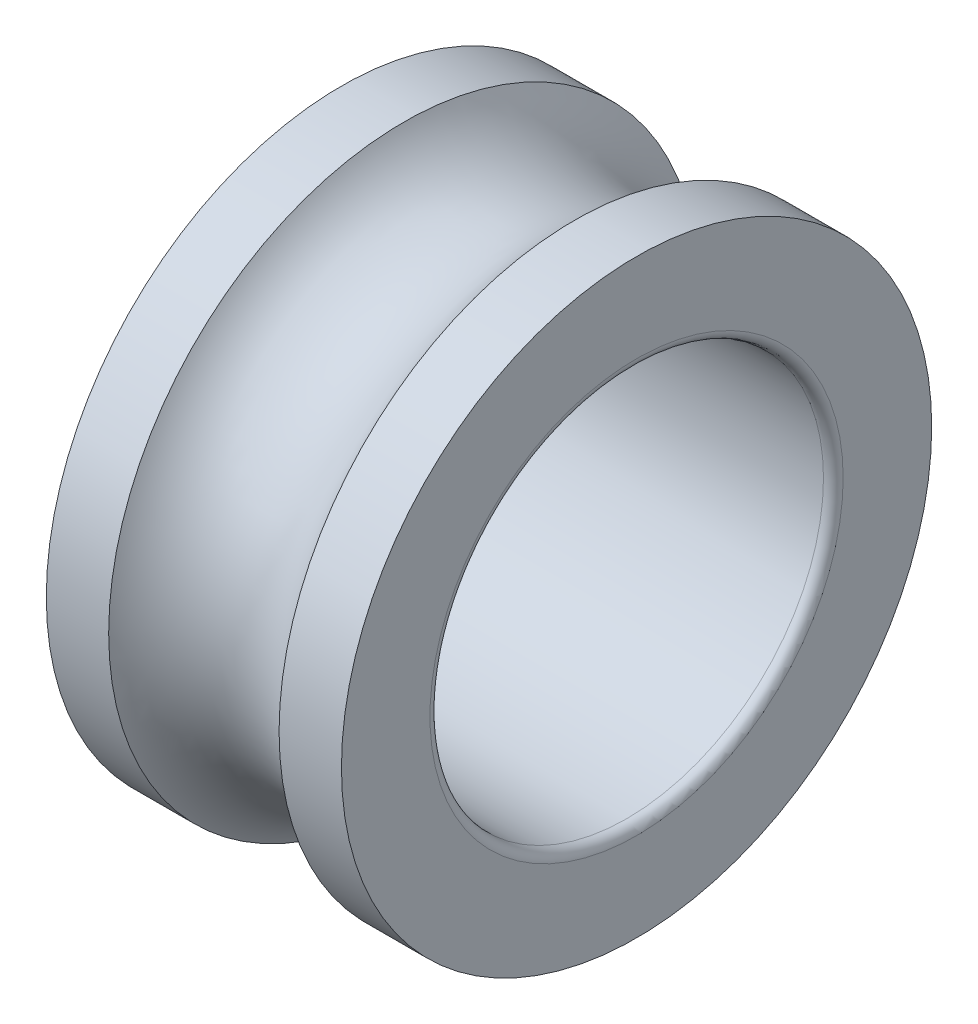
ISO-10303-21;
HEADER;
FILE_DESCRIPTION(('STEP AP214'),'2;1');
FILE_NAME('part.step','',(''),(''),'','','');
FILE_SCHEMA(('AUTOMOTIVE_DESIGN { 1 0 10303 214 1 1 1 1 }'));
ENDSEC;
DATA;
#1=APPLICATION_CONTEXT('core data for automotive mechanical design processes');
#2=APPLICATION_PROTOCOL_DEFINITION('international standard','automotive_design',2000,#1);
#3=PRODUCT_CONTEXT('',#1,'mechanical');
#4=PRODUCT('Part','Part','',(#3));
#5=PRODUCT_RELATED_PRODUCT_CATEGORY('part','',(#4));
#6=PRODUCT_DEFINITION_FORMATION('','',#4);
#7=PRODUCT_DEFINITION_CONTEXT('part definition',#1,'design');
#8=PRODUCT_DEFINITION('design','',#6,#7);
#9=PRODUCT_DEFINITION_SHAPE('','',#8);
#10=(LENGTH_UNIT() NAMED_UNIT(*) SI_UNIT(.MILLI.,.METRE.));
#11=(NAMED_UNIT(*) PLANE_ANGLE_UNIT() SI_UNIT($,.RADIAN.));
#12=(NAMED_UNIT(*) SI_UNIT($,.STERADIAN.) SOLID_ANGLE_UNIT());
#13=UNCERTAINTY_MEASURE_WITH_UNIT(LENGTH_MEASURE(1.E-05),#10,'distance_accuracy_value','');
#14=(GEOMETRIC_REPRESENTATION_CONTEXT(3) GLOBAL_UNCERTAINTY_ASSIGNED_CONTEXT((#13)) GLOBAL_UNIT_ASSIGNED_CONTEXT((#10,
#11,#12)) REPRESENTATION_CONTEXT('',''));
#15=CARTESIAN_POINT('',(0.,0.,0.));
#16=DIRECTION('',(0.,0.,1.));
#17=DIRECTION('',(1.,0.,0.));
#18=AXIS2_PLACEMENT_3D('',#15,#16,#17);
#19=CARTESIAN_POINT('',(-2.99999999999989,3.9999999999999,0.));
#20=DIRECTION('',(-1.,0.,0.));
#21=DIRECTION('',(0.,0.,1.));
#22=AXIS2_PLACEMENT_3D('',#19,#20,#21);
#23=PLANE('',#22);
#24=CARTESIAN_POINT('',(-2.99999999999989,-1.11022302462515E-13,0.));
#25=DIRECTION('',(-1.,0.,0.));
#26=DIRECTION('',(0.,0.,1.));
#27=AXIS2_PLACEMENT_3D('',#24,#25,#26);
#28=CIRCLE('',#27,4.2);
#29=CARTESIAN_POINT('',(-2.99999999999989,-1.11022302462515E-13,4.2));
#30=VERTEX_POINT('',#29);
#31=EDGE_CURVE('E360',#30,#30,#28,.F.);
#32=ORIENTED_EDGE('',*,*,#31,.T.);
#33=EDGE_LOOP('',(#32));
#34=FACE_BOUND('',#33,.T.);
#35=CARTESIAN_POINT('',(-2.99999999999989,-1.11022302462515E-13,0.));
#36=DIRECTION('',(-1.,0.,0.));
#37=DIRECTION('',(0.,0.,1.));
#38=AXIS2_PLACEMENT_3D('',#35,#36,#37);
#39=CIRCLE('',#38,6.);
#40=CARTESIAN_POINT('',(-2.99999999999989,-1.11022302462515E-13,6.));
#41=VERTEX_POINT('',#40);
#42=EDGE_CURVE('E382',#41,#41,#39,.T.);
#43=ORIENTED_EDGE('',*,*,#42,.T.);
#44=EDGE_LOOP('',(#43));
#45=FACE_BOUND('',#44,.T.);
#46=ADVANCED_FACE('F354',(#34,#45),#23,.T.);
#47=CARTESIAN_POINT('',(-8.450166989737,-1.11022302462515E-13,0.));
#48=DIRECTION('',(-1.,0.,0.));
#49=DIRECTION('',(0.,0.,1.));
#50=AXIS2_PLACEMENT_3D('',#47,#48,#49);
#51=CYLINDRICAL_SURFACE('',#50,4.);
#52=CARTESIAN_POINT('',(-2.79999999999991,-1.11022302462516E-13,0.));
#53=DIRECTION('',(-1.,0.,0.));
#54=DIRECTION('',(0.,0.,1.));
#55=AXIS2_PLACEMENT_3D('',#52,#53,#54);
#56=CIRCLE('',#55,4.);
#57=CARTESIAN_POINT('',(-2.79999999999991,-1.11022302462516E-13,4.));
#58=VERTEX_POINT('',#57);
#59=EDGE_CURVE('E364',#58,#58,#56,.T.);
#60=ORIENTED_EDGE('',*,*,#59,.T.);
#61=EDGE_LOOP('',(#60));
#62=FACE_BOUND('',#61,.T.);
#63=CARTESIAN_POINT('',(2.79999999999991,0.,0.));
#64=DIRECTION('',(1.,0.,0.));
#65=DIRECTION('',(0.,0.,-1.));
#66=AXIS2_PLACEMENT_3D('',#63,#64,#65);
#67=CIRCLE('',#66,4.);
#68=CARTESIAN_POINT('',(2.79999999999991,0.,-4.));
#69=VERTEX_POINT('',#68);
#70=EDGE_CURVE('E368',#69,#69,#67,.T.);
#71=ORIENTED_EDGE('',*,*,#70,.T.);
#72=EDGE_LOOP('',(#71));
#73=FACE_BOUND('',#72,.T.);
#74=ADVANCED_FACE('F406',(#62,#73),#51,.F.);
#75=CARTESIAN_POINT('',(2.99999999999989,6.00000000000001,0.));
#76=DIRECTION('',(1.,0.,0.));
#77=DIRECTION('',(0.,0.,-1.));
#78=AXIS2_PLACEMENT_3D('',#75,#76,#77);
#79=PLANE('',#78);
#80=CARTESIAN_POINT('',(2.99999999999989,0.,0.));
#81=DIRECTION('',(1.,0.,0.));
#82=DIRECTION('',(0.,0.,-1.));
#83=AXIS2_PLACEMENT_3D('',#80,#81,#82);
#84=CIRCLE('',#83,4.2);
#85=CARTESIAN_POINT('',(2.99999999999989,0.,-4.2));
#86=VERTEX_POINT('',#85);
#87=EDGE_CURVE('E12',#86,#86,#84,.F.);
#88=ORIENTED_EDGE('',*,*,#87,.T.);
#89=EDGE_LOOP('',(#88));
#90=FACE_BOUND('',#89,.T.);
#91=CARTESIAN_POINT('',(2.99999999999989,0.,0.));
#92=DIRECTION('',(-1.,0.,0.));
#93=DIRECTION('',(0.,0.,1.));
#94=AXIS2_PLACEMENT_3D('',#91,#92,#93);
#95=CIRCLE('',#94,6.);
#96=CARTESIAN_POINT('',(2.99999999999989,0.,6.));
#97=VERTEX_POINT('',#96);
#98=EDGE_CURVE('E373',#97,#97,#95,.T.);
#99=ORIENTED_EDGE('',*,*,#98,.F.);
#100=EDGE_LOOP('',(#99));
#101=FACE_BOUND('',#100,.T.);
#102=ADVANCED_FACE('F402',(#90,#101),#79,.T.);
#103=CARTESIAN_POINT('',(-8.450166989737,-1.11022302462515E-13,0.));
#104=DIRECTION('',(-1.,0.,0.));
#105=DIRECTION('',(0.,0.,1.));
#106=AXIS2_PLACEMENT_3D('',#103,#104,#105);
#107=CYLINDRICAL_SURFACE('',#106,6.);
#108=CARTESIAN_POINT('',(1.73205080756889,0.,0.));
#109=DIRECTION('',(-1.,0.,0.));
#110=DIRECTION('',(0.,0.,1.));
#111=AXIS2_PLACEMENT_3D('',#108,#109,#110);
#112=CIRCLE('',#111,6.);
#113=CARTESIAN_POINT('',(1.73205080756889,0.,6.));
#114=VERTEX_POINT('',#113);
#115=EDGE_CURVE('E376',#114,#114,#112,.T.);
#116=ORIENTED_EDGE('',*,*,#115,.F.);
#117=EDGE_LOOP('',(#116));
#118=FACE_BOUND('',#117,.T.);
#119=ORIENTED_EDGE('',*,*,#98,.T.);
#120=EDGE_LOOP('',(#119));
#121=FACE_BOUND('',#120,.T.);
#122=ADVANCED_FACE('F396',(#118,#121),#107,.T.);
#123=CARTESIAN_POINT('',(0.,0.,0.));
#124=DIRECTION('',(-1.,0.,0.));
#125=DIRECTION('',(0.,0.,1.));
#126=AXIS2_PLACEMENT_3D('',#123,#124,#125);
#127=TOROIDAL_SURFACE('',#126,7.,2.);
#128=ORIENTED_EDGE('',*,*,#115,.T.);
#129=EDGE_LOOP('',(#128));
#130=FACE_BOUND('',#129,.T.);
#131=CARTESIAN_POINT('',(-1.73205080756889,0.,0.));
#132=DIRECTION('',(-1.,0.,0.));
#133=DIRECTION('',(0.,0.,1.));
#134=AXIS2_PLACEMENT_3D('',#131,#132,#133);
#135=CIRCLE('',#134,6.);
#136=CARTESIAN_POINT('',(-1.73205080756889,0.,6.));
#137=VERTEX_POINT('',#136);
#138=EDGE_CURVE('E379',#137,#137,#135,.T.);
#139=ORIENTED_EDGE('',*,*,#138,.F.);
#140=EDGE_LOOP('',(#139));
#141=FACE_BOUND('',#140,.T.);
#142=ADVANCED_FACE('F391',(#130,#141),#127,.F.);
#143=CARTESIAN_POINT('',(-8.450166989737,-1.11022302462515E-13,0.));
#144=DIRECTION('',(-1.,0.,0.));
#145=DIRECTION('',(0.,0.,1.));
#146=AXIS2_PLACEMENT_3D('',#143,#144,#145);
#147=CYLINDRICAL_SURFACE('',#146,6.);
#148=ORIENTED_EDGE('',*,*,#42,.F.);
#149=EDGE_LOOP('',(#148));
#150=FACE_BOUND('',#149,.T.);
#151=ORIENTED_EDGE('',*,*,#138,.T.);
#152=EDGE_LOOP('',(#151));
#153=FACE_BOUND('',#152,.T.);
#154=ADVANCED_FACE('F387',(#150,#153),#147,.T.);
#155=CARTESIAN_POINT('',(-2.79999999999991,-1.11022302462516E-13,0.));
#156=DIRECTION('',(-1.,0.,0.));
#157=DIRECTION('',(0.,0.,1.));
#158=AXIS2_PLACEMENT_3D('',#155,#156,#157);
#159=TOROIDAL_SURFACE('',#158,4.2,0.2);
#160=ORIENTED_EDGE('',*,*,#31,.F.);
#161=EDGE_LOOP('',(#160));
#162=FACE_BOUND('',#161,.T.);
#163=ORIENTED_EDGE('',*,*,#59,.F.);
#164=EDGE_LOOP('',(#163));
#165=FACE_BOUND('',#164,.T.);
#166=ADVANCED_FACE('F390',(#162,#165),#159,.T.);
#167=CARTESIAN_POINT('',(2.79999999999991,0.,0.));
#168=DIRECTION('',(1.,0.,0.));
#169=DIRECTION('',(0.,0.,-1.));
#170=AXIS2_PLACEMENT_3D('',#167,#168,#169);
#171=TOROIDAL_SURFACE('',#170,4.2,0.2);
#172=ORIENTED_EDGE('',*,*,#70,.F.);
#173=EDGE_LOOP('',(#172));
#174=FACE_BOUND('',#173,.T.);
#175=ORIENTED_EDGE('',*,*,#87,.F.);
#176=EDGE_LOOP('',(#175));
#177=FACE_BOUND('',#176,.T.);
#178=ADVANCED_FACE('F419',(#174,#177),#171,.T.);
#179=CLOSED_SHELL('',(#46,#74,#102,#122,#142,#154,#166,#178));
#180=MANIFOLD_SOLID_BREP('B2',#179);
#181=ADVANCED_BREP_SHAPE_REPRESENTATION('',(#18,#180),#14);
#182=SHAPE_DEFINITION_REPRESENTATION(#9,#181);
ENDSEC;
END-ISO-10303-21;
